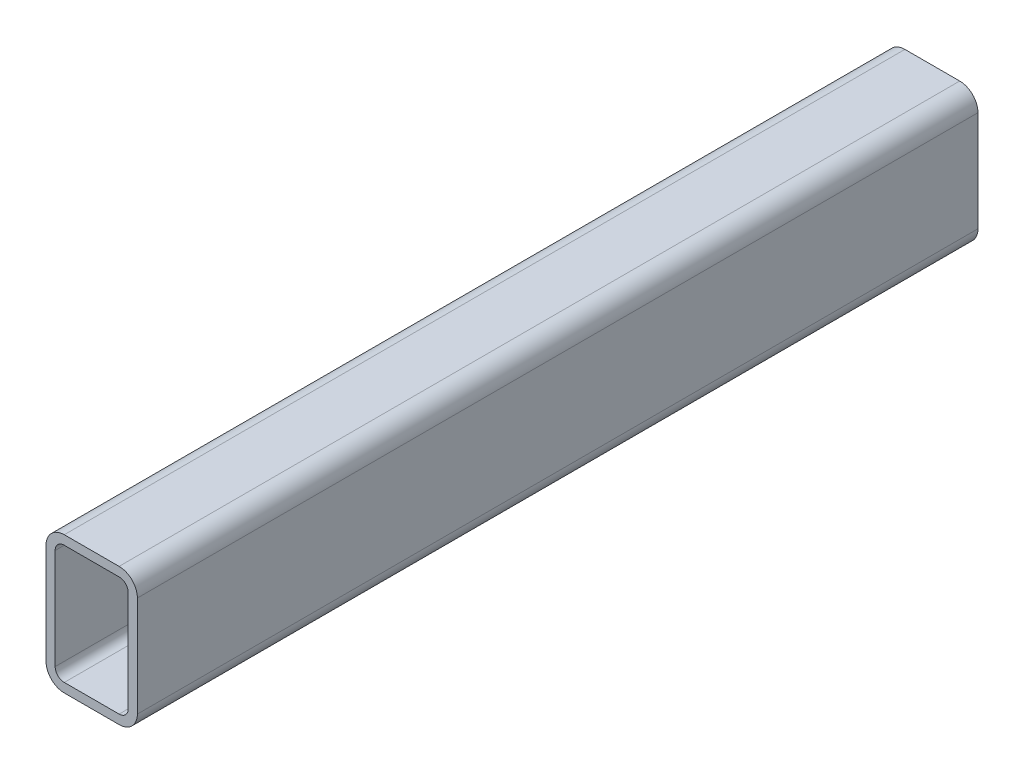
from build123d import *

# Parameters (mm, degrees)
EXTRUSION1_DEPTH = 460


with BuildPart() as part:
    # Esquisse1 → Extrusion1 (new, symmetric)
    with BuildSketch(Plane.XY):
        with BuildLine():
            Line((20, 0), (80, 0))
            ThreePointArc((80, 0), (94.142135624, 5.857864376), (100, 20))
            Line((100, 20), (100, 130))
            ThreePointArc((100, 130), (94.142135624, 144.142135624), (80, 150))
            Line((80, 150), (20, 150))
            ThreePointArc((20, 150), (5.857864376, 144.142135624), (0, 130))
            Line((0, 130), (0, 20))
            ThreePointArc((0, 20), (5.857864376, 5.857864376), (20, 0))
        make_face()
        with BuildLine():
            Line((80, 140), (20, 140))
            ThreePointArc((20, 140), (12.928932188, 137.071067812), (10, 130))
            Line((10, 130), (10, 20))
            ThreePointArc((10, 20), (12.928932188, 12.928932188), (20, 10))
            Line((20, 10), (80, 10))
            ThreePointArc((80, 10), (87.071067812, 12.928932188), (90, 20))
            Line((90, 20), (90, 130))
            ThreePointArc((90, 130), (87.071067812, 137.071067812), (80, 140))
        make_face(mode=Mode.SUBTRACT)
    extrude(amount=EXTRUSION1_DEPTH, both=True)


solid = part.part
